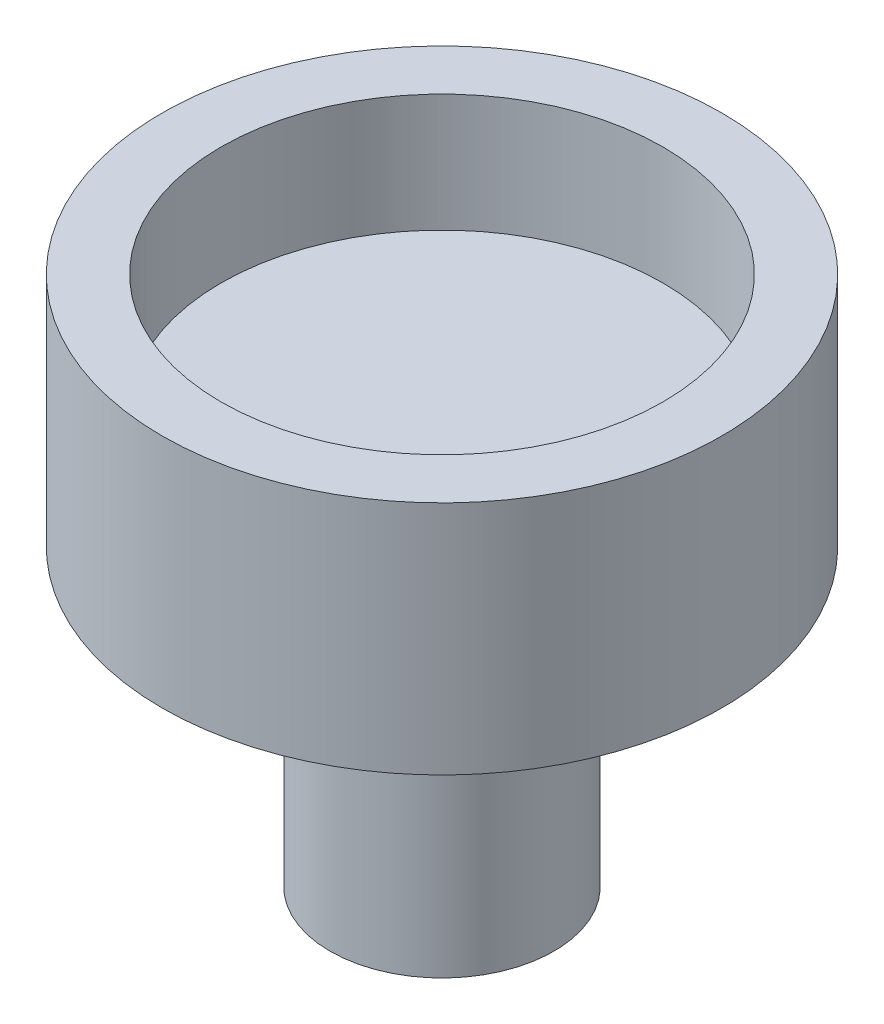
ISO-10303-21;
HEADER;
FILE_DESCRIPTION(('STEP AP214'),'2;1');
FILE_NAME('part.step','',(''),(''),'','','');
FILE_SCHEMA(('AUTOMOTIVE_DESIGN { 1 0 10303 214 1 1 1 1 }'));
ENDSEC;
DATA;
#1=APPLICATION_CONTEXT('core data for automotive mechanical design processes');
#2=APPLICATION_PROTOCOL_DEFINITION('international standard','automotive_design',2000,#1);
#3=PRODUCT_CONTEXT('',#1,'mechanical');
#4=PRODUCT('Part','Part','',(#3));
#5=PRODUCT_RELATED_PRODUCT_CATEGORY('part','',(#4));
#6=PRODUCT_DEFINITION_FORMATION('','',#4);
#7=PRODUCT_DEFINITION_CONTEXT('part definition',#1,'design');
#8=PRODUCT_DEFINITION('design','',#6,#7);
#9=PRODUCT_DEFINITION_SHAPE('','',#8);
#10=(LENGTH_UNIT() NAMED_UNIT(*) SI_UNIT(.MILLI.,.METRE.));
#11=(NAMED_UNIT(*) PLANE_ANGLE_UNIT() SI_UNIT($,.RADIAN.));
#12=(NAMED_UNIT(*) SI_UNIT($,.STERADIAN.) SOLID_ANGLE_UNIT());
#13=UNCERTAINTY_MEASURE_WITH_UNIT(LENGTH_MEASURE(1.E-05),#10,'distance_accuracy_value','');
#14=(GEOMETRIC_REPRESENTATION_CONTEXT(3) GLOBAL_UNCERTAINTY_ASSIGNED_CONTEXT((#13)) GLOBAL_UNIT_ASSIGNED_CONTEXT((#10,
#11,#12)) REPRESENTATION_CONTEXT('',''));
#15=CARTESIAN_POINT('',(0.,0.,0.));
#16=DIRECTION('',(0.,0.,1.));
#17=DIRECTION('',(1.,0.,0.));
#18=AXIS2_PLACEMENT_3D('',#15,#16,#17);
#19=CARTESIAN_POINT('',(0.,0.,0.));
#20=DIRECTION('',(0.,-1.,0.));
#21=DIRECTION('',(0.,0.,-1.));
#22=AXIS2_PLACEMENT_3D('',#19,#20,#21);
#23=CYLINDRICAL_SURFACE('',#22,6.0325);
#24=CARTESIAN_POINT('',(0.,6.35,0.));
#25=DIRECTION('',(0.,-1.,0.));
#26=DIRECTION('',(0.,0.,-1.));
#27=AXIS2_PLACEMENT_3D('',#24,#25,#26);
#28=CIRCLE('',#27,6.0325);
#29=CARTESIAN_POINT('',(0.,6.35,-6.0325));
#30=VERTEX_POINT('',#29);
#31=EDGE_CURVE('E69',#30,#30,#28,.T.);
#32=ORIENTED_EDGE('',*,*,#31,.F.);
#33=EDGE_LOOP('',(#32));
#34=FACE_BOUND('',#33,.T.);
#35=CARTESIAN_POINT('',(0.,11.43,0.));
#36=DIRECTION('',(0.,-1.,0.));
#37=DIRECTION('',(0.,0.,-1.));
#38=AXIS2_PLACEMENT_3D('',#35,#36,#37);
#39=CIRCLE('',#38,6.0325);
#40=CARTESIAN_POINT('',(0.,11.43,-6.0325));
#41=VERTEX_POINT('',#40);
#42=EDGE_CURVE('E10',#41,#41,#39,.T.);
#43=ORIENTED_EDGE('',*,*,#42,.T.);
#44=EDGE_LOOP('',(#43));
#45=FACE_BOUND('',#44,.T.);
#46=ADVANCED_FACE('F41',(#34,#45),#23,.T.);
#47=CARTESIAN_POINT('',(-6.0325,11.43,0.));
#48=DIRECTION('',(0.,-1.,0.));
#49=DIRECTION('',(0.,0.,-1.));
#50=AXIS2_PLACEMENT_3D('',#47,#48,#49);
#51=PLANE('',#50);
#52=ORIENTED_EDGE('',*,*,#42,.F.);
#53=EDGE_LOOP('',(#52));
#54=FACE_BOUND('',#53,.T.);
#55=CARTESIAN_POINT('',(0.,11.43,0.));
#56=DIRECTION('',(0.,-1.,0.));
#57=DIRECTION('',(0.,0.,-1.));
#58=AXIS2_PLACEMENT_3D('',#55,#56,#57);
#59=CIRCLE('',#58,4.7625);
#60=CARTESIAN_POINT('',(0.,11.43,-4.7625));
#61=VERTEX_POINT('',#60);
#62=EDGE_CURVE('E47',#61,#61,#59,.T.);
#63=ORIENTED_EDGE('',*,*,#62,.T.);
#64=EDGE_LOOP('',(#63));
#65=FACE_BOUND('',#64,.T.);
#66=ADVANCED_FACE('F76',(#54,#65),#51,.F.);
#67=CARTESIAN_POINT('',(0.,0.,0.));
#68=DIRECTION('',(0.,-1.,0.));
#69=DIRECTION('',(0.,0.,-1.));
#70=AXIS2_PLACEMENT_3D('',#67,#68,#69);
#71=CYLINDRICAL_SURFACE('',#70,4.7625);
#72=ORIENTED_EDGE('',*,*,#62,.F.);
#73=EDGE_LOOP('',(#72));
#74=FACE_BOUND('',#73,.T.);
#75=CARTESIAN_POINT('',(0.,8.89,0.));
#76=DIRECTION('',(0.,-1.,0.));
#77=DIRECTION('',(0.,0.,-1.));
#78=AXIS2_PLACEMENT_3D('',#75,#76,#77);
#79=CIRCLE('',#78,4.7625);
#80=CARTESIAN_POINT('',(0.,8.89,-4.7625));
#81=VERTEX_POINT('',#80);
#82=EDGE_CURVE('E51',#81,#81,#79,.T.);
#83=ORIENTED_EDGE('',*,*,#82,.T.);
#84=EDGE_LOOP('',(#83));
#85=FACE_BOUND('',#84,.T.);
#86=ADVANCED_FACE('F80',(#74,#85),#71,.F.);
#87=CARTESIAN_POINT('',(-4.7625,8.89,0.));
#88=DIRECTION('',(0.,-1.,0.));
#89=DIRECTION('',(0.,0.,-1.));
#90=AXIS2_PLACEMENT_3D('',#87,#88,#89);
#91=PLANE('',#90);
#92=ORIENTED_EDGE('',*,*,#82,.F.);
#93=EDGE_LOOP('',(#92));
#94=FACE_BOUND('',#93,.T.);
#95=ADVANCED_FACE('F85',(#94),#91,.F.);
#96=CARTESIAN_POINT('',(-2.413,0.,0.));
#97=DIRECTION('',(0.,1.,0.));
#98=DIRECTION('',(0.,0.,1.));
#99=AXIS2_PLACEMENT_3D('',#96,#97,#98);
#100=PLANE('',#99);
#101=CARTESIAN_POINT('',(0.,0.,0.));
#102=DIRECTION('',(0.,-1.,0.));
#103=DIRECTION('',(0.,0.,-1.));
#104=AXIS2_PLACEMENT_3D('',#101,#102,#103);
#105=CIRCLE('',#104,2.413);
#106=CARTESIAN_POINT('',(0.,0.,-2.413));
#107=VERTEX_POINT('',#106);
#108=EDGE_CURVE('E55',#107,#107,#105,.T.);
#109=ORIENTED_EDGE('',*,*,#108,.T.);
#110=EDGE_LOOP('',(#109));
#111=FACE_BOUND('',#110,.T.);
#112=ADVANCED_FACE('F91',(#111),#100,.F.);
#113=CARTESIAN_POINT('',(0.,0.,0.));
#114=DIRECTION('',(0.,-1.,0.));
#115=DIRECTION('',(0.,0.,-1.));
#116=AXIS2_PLACEMENT_3D('',#113,#114,#115);
#117=CYLINDRICAL_SURFACE('',#116,2.413);
#118=ORIENTED_EDGE('',*,*,#108,.F.);
#119=EDGE_LOOP('',(#118));
#120=FACE_BOUND('',#119,.T.);
#121=CARTESIAN_POINT('',(0.,5.08,0.));
#122=DIRECTION('',(0.,-1.,0.));
#123=DIRECTION('',(0.,0.,-1.));
#124=AXIS2_PLACEMENT_3D('',#121,#122,#123);
#125=CIRCLE('',#124,2.413);
#126=CARTESIAN_POINT('',(0.,5.08,-2.413));
#127=VERTEX_POINT('',#126);
#128=EDGE_CURVE('E60',#127,#127,#125,.T.);
#129=ORIENTED_EDGE('',*,*,#128,.T.);
#130=EDGE_LOOP('',(#129));
#131=FACE_BOUND('',#130,.T.);
#132=ADVANCED_FACE('F95',(#120,#131),#117,.T.);
#133=CARTESIAN_POINT('',(-1.5875,5.08,0.));
#134=DIRECTION('',(0.,-1.,0.));
#135=DIRECTION('',(0.,0.,-1.));
#136=AXIS2_PLACEMENT_3D('',#133,#134,#135);
#137=PLANE('',#136);
#138=ORIENTED_EDGE('',*,*,#128,.F.);
#139=EDGE_LOOP('',(#138));
#140=FACE_BOUND('',#139,.T.);
#141=CARTESIAN_POINT('',(0.,5.08,0.));
#142=DIRECTION('',(0.,-1.,0.));
#143=DIRECTION('',(0.,0.,-1.));
#144=AXIS2_PLACEMENT_3D('',#141,#142,#143);
#145=CIRCLE('',#144,1.5875);
#146=CARTESIAN_POINT('',(0.,5.08,-1.5875));
#147=VERTEX_POINT('',#146);
#148=EDGE_CURVE('E63',#147,#147,#145,.T.);
#149=ORIENTED_EDGE('',*,*,#148,.T.);
#150=EDGE_LOOP('',(#149));
#151=FACE_BOUND('',#150,.T.);
#152=ADVANCED_FACE('F99',(#140,#151),#137,.F.);
#153=CARTESIAN_POINT('',(0.,0.,0.));
#154=DIRECTION('',(0.,-1.,0.));
#155=DIRECTION('',(0.,0.,-1.));
#156=AXIS2_PLACEMENT_3D('',#153,#154,#155);
#157=CYLINDRICAL_SURFACE('',#156,1.5875);
#158=ORIENTED_EDGE('',*,*,#148,.F.);
#159=EDGE_LOOP('',(#158));
#160=FACE_BOUND('',#159,.T.);
#161=CARTESIAN_POINT('',(0.,6.35,0.));
#162=DIRECTION('',(0.,-1.,0.));
#163=DIRECTION('',(0.,0.,-1.));
#164=AXIS2_PLACEMENT_3D('',#161,#162,#163);
#165=CIRCLE('',#164,1.5875);
#166=CARTESIAN_POINT('',(0.,6.35,-1.5875));
#167=VERTEX_POINT('',#166);
#168=EDGE_CURVE('E66',#167,#167,#165,.T.);
#169=ORIENTED_EDGE('',*,*,#168,.T.);
#170=EDGE_LOOP('',(#169));
#171=FACE_BOUND('',#170,.T.);
#172=ADVANCED_FACE('F103',(#160,#171),#157,.T.);
#173=CARTESIAN_POINT('',(-1.5875,6.35,0.));
#174=DIRECTION('',(0.,1.,0.));
#175=DIRECTION('',(0.,0.,1.));
#176=AXIS2_PLACEMENT_3D('',#173,#174,#175);
#177=PLANE('',#176);
#178=ORIENTED_EDGE('',*,*,#168,.F.);
#179=EDGE_LOOP('',(#178));
#180=FACE_BOUND('',#179,.T.);
#181=ORIENTED_EDGE('',*,*,#31,.T.);
#182=EDGE_LOOP('',(#181));
#183=FACE_BOUND('',#182,.T.);
#184=ADVANCED_FACE('F73',(#180,#183),#177,.F.);
#185=CLOSED_SHELL('',(#46,#66,#86,#95,#112,#132,#152,#172,#184));
#186=MANIFOLD_SOLID_BREP('B2',#185);
#187=ADVANCED_BREP_SHAPE_REPRESENTATION('',(#18,#186),#14);
#188=SHAPE_DEFINITION_REPRESENTATION(#9,#187);
ENDSEC;
END-ISO-10303-21;
